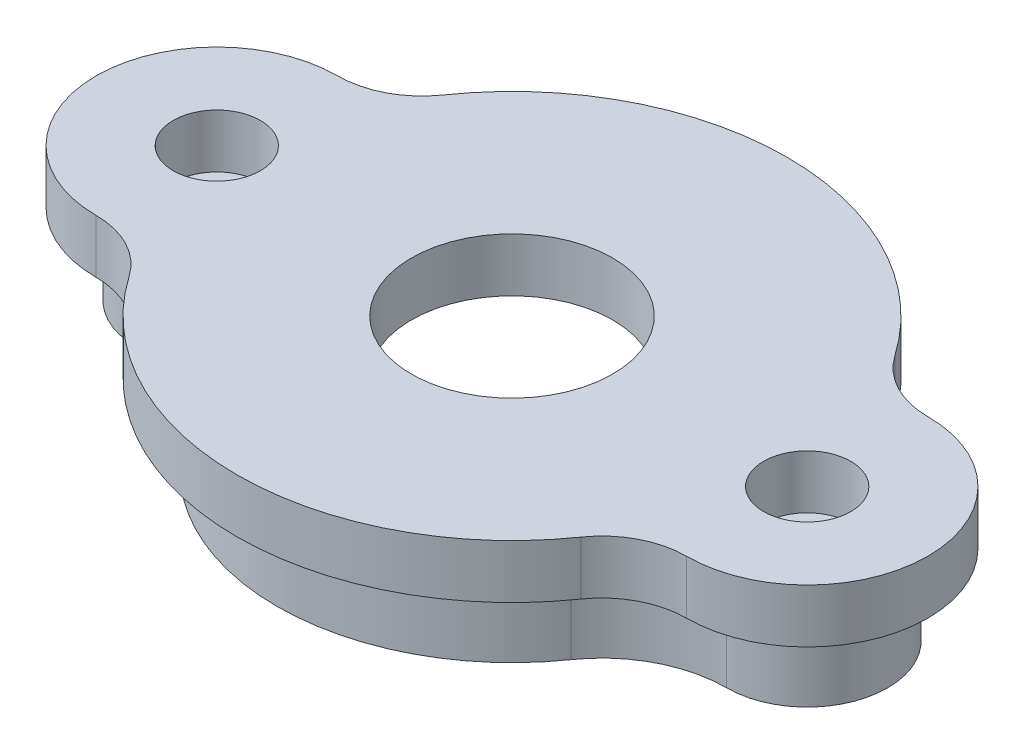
ISO-10303-21;
HEADER;
FILE_DESCRIPTION(('STEP AP214'),'2;1');
FILE_NAME('part.step','',(''),(''),'','','');
FILE_SCHEMA(('AUTOMOTIVE_DESIGN { 1 0 10303 214 1 1 1 1 }'));
ENDSEC;
DATA;
#1=APPLICATION_CONTEXT('core data for automotive mechanical design processes');
#2=APPLICATION_PROTOCOL_DEFINITION('international standard','automotive_design',2000,#1);
#3=PRODUCT_CONTEXT('',#1,'mechanical');
#4=PRODUCT('Part','Part','',(#3));
#5=PRODUCT_RELATED_PRODUCT_CATEGORY('part','',(#4));
#6=PRODUCT_DEFINITION_FORMATION('','',#4);
#7=PRODUCT_DEFINITION_CONTEXT('part definition',#1,'design');
#8=PRODUCT_DEFINITION('design','',#6,#7);
#9=PRODUCT_DEFINITION_SHAPE('','',#8);
#10=(LENGTH_UNIT() NAMED_UNIT(*) SI_UNIT(.MILLI.,.METRE.));
#11=(NAMED_UNIT(*) PLANE_ANGLE_UNIT() SI_UNIT($,.RADIAN.));
#12=(NAMED_UNIT(*) SI_UNIT($,.STERADIAN.) SOLID_ANGLE_UNIT());
#13=UNCERTAINTY_MEASURE_WITH_UNIT(LENGTH_MEASURE(1.E-05),#10,'distance_accuracy_value','');
#14=(GEOMETRIC_REPRESENTATION_CONTEXT(3) GLOBAL_UNCERTAINTY_ASSIGNED_CONTEXT((#13)) GLOBAL_UNIT_ASSIGNED_CONTEXT((#10,
#11,#12)) REPRESENTATION_CONTEXT('',''));
#15=CARTESIAN_POINT('',(0.,0.,0.));
#16=DIRECTION('',(0.,0.,1.));
#17=DIRECTION('',(1.,0.,0.));
#18=AXIS2_PLACEMENT_3D('',#15,#16,#17);
#19=CARTESIAN_POINT('',(0.,-6.,0.));
#20=DIRECTION('',(0.,-1.,0.));
#21=DIRECTION('',(0.,0.,-1.));
#22=AXIS2_PLACEMENT_3D('',#19,#20,#21);
#23=PLANE('',#22);
#24=CARTESIAN_POINT('',(0.,-6.,0.));
#25=DIRECTION('',(0.,-1.,0.));
#26=DIRECTION('',(0.,0.,-1.));
#27=AXIS2_PLACEMENT_3D('',#24,#25,#26);
#28=CIRCLE('',#27,16.);
#29=CARTESIAN_POINT('',(0.,-6.,-16.));
#30=VERTEX_POINT('',#29);
#31=EDGE_CURVE('E649',#30,#30,#28,.T.);
#32=ORIENTED_EDGE('',*,*,#31,.F.);
#33=EDGE_LOOP('',(#32));
#34=FACE_BOUND('',#33,.T.);
#35=CARTESIAN_POINT('',(22.,-6.,15.2934782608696));
#36=DIRECTION('',(0.,-1.,0.));
#37=DIRECTION('',(0.,0.,-1.));
#38=AXIS2_PLACEMENT_3D('',#35,#36,#37);
#39=CIRCLE('',#38,9.29347826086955);
#40=CARTESIAN_POINT('',(14.369168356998,-6.,9.98884381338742));
#41=VERTEX_POINT('',#40);
#42=CARTESIAN_POINT('',(22.,-6.,6.));
#43=VERTEX_POINT('',#42);
#44=EDGE_CURVE('E160',#41,#43,#39,.T.);
#45=ORIENTED_EDGE('',*,*,#44,.F.);
#46=CARTESIAN_POINT('',(0.,-6.,0.));
#47=DIRECTION('',(0.,-1.,0.));
#48=DIRECTION('',(0.,0.,-1.));
#49=AXIS2_PLACEMENT_3D('',#46,#47,#48);
#50=CIRCLE('',#49,17.5);
#51=CARTESIAN_POINT('',(-14.369168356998,-6.,9.98884381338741));
#52=VERTEX_POINT('',#51);
#53=EDGE_CURVE('E168',#41,#52,#50,.T.);
#54=ORIENTED_EDGE('',*,*,#53,.T.);
#55=CARTESIAN_POINT('',(-22.,-6.,15.2934782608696));
#56=DIRECTION('',(0.,-1.,0.));
#57=DIRECTION('',(0.,0.,-1.));
#58=AXIS2_PLACEMENT_3D('',#55,#56,#57);
#59=CIRCLE('',#58,9.29347826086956);
#60=CARTESIAN_POINT('',(-22.,-6.,6.));
#61=VERTEX_POINT('',#60);
#62=EDGE_CURVE('E175',#61,#52,#59,.T.);
#63=ORIENTED_EDGE('',*,*,#62,.F.);
#64=CARTESIAN_POINT('',(-22.,-6.,0.));
#65=DIRECTION('',(0.,-1.,0.));
#66=DIRECTION('',(0.,0.,-1.));
#67=AXIS2_PLACEMENT_3D('',#64,#65,#66);
#68=CIRCLE('',#67,6.);
#69=CARTESIAN_POINT('',(-22.,-6.,-6.));
#70=VERTEX_POINT('',#69);
#71=EDGE_CURVE('E193',#61,#70,#68,.T.);
#72=ORIENTED_EDGE('',*,*,#71,.T.);
#73=CARTESIAN_POINT('',(-22.,-6.,-15.2934782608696));
#74=DIRECTION('',(0.,-1.,0.));
#75=DIRECTION('',(0.,0.,-1.));
#76=AXIS2_PLACEMENT_3D('',#73,#74,#75);
#77=CIRCLE('',#76,9.29347826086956);
#78=CARTESIAN_POINT('',(-14.369168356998,-6.,-9.98884381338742));
#79=VERTEX_POINT('',#78);
#80=EDGE_CURVE('E196',#79,#70,#77,.T.);
#81=ORIENTED_EDGE('',*,*,#80,.F.);
#82=CARTESIAN_POINT('',(0.,-6.,0.));
#83=DIRECTION('',(0.,-1.,0.));
#84=DIRECTION('',(0.,0.,-1.));
#85=AXIS2_PLACEMENT_3D('',#82,#83,#84);
#86=CIRCLE('',#85,17.5);
#87=CARTESIAN_POINT('',(14.369168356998,-6.,-9.98884381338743));
#88=VERTEX_POINT('',#87);
#89=EDGE_CURVE('E200',#79,#88,#86,.T.);
#90=ORIENTED_EDGE('',*,*,#89,.T.);
#91=CARTESIAN_POINT('',(22.,-6.,-15.2934782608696));
#92=DIRECTION('',(0.,-1.,0.));
#93=DIRECTION('',(0.,0.,-1.));
#94=AXIS2_PLACEMENT_3D('',#91,#92,#93);
#95=CIRCLE('',#94,9.29347826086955);
#96=CARTESIAN_POINT('',(22.,-6.,-6.));
#97=VERTEX_POINT('',#96);
#98=EDGE_CURVE('E203',#97,#88,#95,.T.);
#99=ORIENTED_EDGE('',*,*,#98,.F.);
#100=CARTESIAN_POINT('',(22.,-6.,0.));
#101=DIRECTION('',(0.,-1.,0.));
#102=DIRECTION('',(0.,0.,-1.));
#103=AXIS2_PLACEMENT_3D('',#100,#101,#102);
#104=CIRCLE('',#103,6.);
#105=EDGE_CURVE('E180',#97,#43,#104,.T.);
#106=ORIENTED_EDGE('',*,*,#105,.T.);
#107=EDGE_LOOP('',(#45,#54,#63,#72,#81,#90,#99,#106));
#108=FACE_BOUND('',#107,.T.);
#109=CARTESIAN_POINT('',(-22.,-5.99999999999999,0.));
#110=DIRECTION('',(0.,1.,0.));
#111=DIRECTION('',(0.,0.,1.));
#112=AXIS2_PLACEMENT_3D('',#109,#110,#111);
#113=CIRCLE('',#112,1.75000000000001);
#114=CARTESIAN_POINT('',(-22.,-5.99999999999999,1.75000000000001));
#115=VERTEX_POINT('',#114);
#116=EDGE_CURVE('E188',#115,#115,#113,.T.);
#117=ORIENTED_EDGE('',*,*,#116,.T.);
#118=EDGE_LOOP('',(#117));
#119=FACE_BOUND('',#118,.T.);
#120=CARTESIAN_POINT('',(22.,-5.99999999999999,0.));
#121=DIRECTION('',(0.,1.,0.));
#122=DIRECTION('',(0.,0.,1.));
#123=AXIS2_PLACEMENT_3D('',#120,#121,#122);
#124=CIRCLE('',#123,1.75000000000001);
#125=CARTESIAN_POINT('',(22.,-5.99999999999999,1.75000000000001));
#126=VERTEX_POINT('',#125);
#127=EDGE_CURVE('E675',#126,#126,#124,.T.);
#128=ORIENTED_EDGE('',*,*,#127,.T.);
#129=EDGE_LOOP('',(#128));
#130=FACE_BOUND('',#129,.T.);
#131=ADVANCED_FACE('F43',(#34,#108,#119,#130),#23,.T.);
#132=CARTESIAN_POINT('',(11.,0.,-7.64673913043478));
#133=DIRECTION('',(0.,-1.,0.));
#134=DIRECTION('',(0.,0.,-1.));
#135=AXIS2_PLACEMENT_3D('',#132,#133,#134);
#136=PLANE('',#135);
#137=CARTESIAN_POINT('',(22.,0.,-15.2934782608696));
#138=DIRECTION('',(0.,-1.,0.));
#139=DIRECTION('',(0.,0.,-1.));
#140=AXIS2_PLACEMENT_3D('',#137,#138,#139);
#141=CIRCLE('',#140,6.29347826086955);
#142=CARTESIAN_POINT('',(22.,0.,-9.));
#143=VERTEX_POINT('',#142);
#144=CARTESIAN_POINT('',(16.8324543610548,0.,-11.7012170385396));
#145=VERTEX_POINT('',#144);
#146=EDGE_CURVE('E164',#143,#145,#141,.T.);
#147=ORIENTED_EDGE('',*,*,#146,.F.);
#148=CARTESIAN_POINT('',(22.,0.,0.));
#149=DIRECTION('',(0.,1.,0.));
#150=DIRECTION('',(0.,0.,1.));
#151=AXIS2_PLACEMENT_3D('',#148,#149,#150);
#152=CIRCLE('',#151,9.);
#153=CARTESIAN_POINT('',(22.,0.,9.));
#154=VERTEX_POINT('',#153);
#155=EDGE_CURVE('E259',#154,#143,#152,.T.);
#156=ORIENTED_EDGE('',*,*,#155,.F.);
#157=CARTESIAN_POINT('',(22.,0.,15.2934782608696));
#158=DIRECTION('',(0.,-1.,0.));
#159=DIRECTION('',(0.,0.,1.));
#160=AXIS2_PLACEMENT_3D('',#157,#158,#159);
#161=CIRCLE('',#160,6.29347826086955);
#162=CARTESIAN_POINT('',(16.8324543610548,0.,11.7012170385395));
#163=VERTEX_POINT('',#162);
#164=EDGE_CURVE('E299',#163,#154,#161,.T.);
#165=ORIENTED_EDGE('',*,*,#164,.F.);
#166=CARTESIAN_POINT('',(0.,0.,0.));
#167=DIRECTION('',(0.,1.,0.));
#168=DIRECTION('',(0.,0.,1.));
#169=AXIS2_PLACEMENT_3D('',#166,#167,#168);
#170=CIRCLE('',#169,20.5);
#171=CARTESIAN_POINT('',(-16.8324543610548,0.,11.7012170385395));
#172=VERTEX_POINT('',#171);
#173=EDGE_CURVE('E296',#172,#163,#170,.T.);
#174=ORIENTED_EDGE('',*,*,#173,.F.);
#175=CARTESIAN_POINT('',(-22.,0.,15.2934782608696));
#176=DIRECTION('',(0.,-1.,0.));
#177=DIRECTION('',(0.,0.,-1.));
#178=AXIS2_PLACEMENT_3D('',#175,#176,#177);
#179=CIRCLE('',#178,6.29347826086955);
#180=CARTESIAN_POINT('',(-22.,0.,9.));
#181=VERTEX_POINT('',#180);
#182=EDGE_CURVE('E293',#181,#172,#179,.T.);
#183=ORIENTED_EDGE('',*,*,#182,.F.);
#184=CARTESIAN_POINT('',(-22.,0.,0.));
#185=DIRECTION('',(0.,1.,0.));
#186=DIRECTION('',(0.,0.,-1.));
#187=AXIS2_PLACEMENT_3D('',#184,#185,#186);
#188=CIRCLE('',#187,9.);
#189=CARTESIAN_POINT('',(-22.,0.,-9.));
#190=VERTEX_POINT('',#189);
#191=EDGE_CURVE('E290',#190,#181,#188,.T.);
#192=ORIENTED_EDGE('',*,*,#191,.F.);
#193=CARTESIAN_POINT('',(-22.,0.,-15.2934782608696));
#194=DIRECTION('',(0.,-1.,0.));
#195=DIRECTION('',(0.,0.,1.));
#196=AXIS2_PLACEMENT_3D('',#193,#194,#195);
#197=CIRCLE('',#196,6.29347826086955);
#198=CARTESIAN_POINT('',(-16.8324543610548,0.,-11.7012170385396));
#199=VERTEX_POINT('',#198);
#200=EDGE_CURVE('E287',#199,#190,#197,.T.);
#201=ORIENTED_EDGE('',*,*,#200,.F.);
#202=CARTESIAN_POINT('',(0.,0.,0.));
#203=DIRECTION('',(0.,1.,0.));
#204=DIRECTION('',(0.,0.,1.));
#205=AXIS2_PLACEMENT_3D('',#202,#203,#204);
#206=CIRCLE('',#205,20.5);
#207=EDGE_CURVE('E284',#145,#199,#206,.T.);
#208=ORIENTED_EDGE('',*,*,#207,.F.);
#209=EDGE_LOOP('',(#147,#156,#165,#174,#183,#192,#201,#208));
#210=FACE_BOUND('',#209,.T.);
#211=CARTESIAN_POINT('',(0.,0.,0.));
#212=DIRECTION('',(0.,-1.,0.));
#213=DIRECTION('',(0.,0.,-1.));
#214=AXIS2_PLACEMENT_3D('',#211,#212,#213);
#215=CIRCLE('',#214,17.5);
#216=CARTESIAN_POINT('',(14.369168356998,0.,9.98884381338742));
#217=VERTEX_POINT('',#216);
#218=CARTESIAN_POINT('',(-14.369168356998,0.,9.98884381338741));
#219=VERTEX_POINT('',#218);
#220=EDGE_CURVE('E212',#217,#219,#215,.T.);
#221=ORIENTED_EDGE('',*,*,#220,.F.);
#222=CARTESIAN_POINT('',(22.,0.,15.2934782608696));
#223=DIRECTION('',(0.,-1.,0.));
#224=DIRECTION('',(0.,0.,-1.));
#225=AXIS2_PLACEMENT_3D('',#222,#223,#224);
#226=CIRCLE('',#225,9.29347826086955);
#227=CARTESIAN_POINT('',(22.,0.,6.));
#228=VERTEX_POINT('',#227);
#229=EDGE_CURVE('E59',#217,#228,#226,.T.);
#230=ORIENTED_EDGE('',*,*,#229,.T.);
#231=CARTESIAN_POINT('',(22.,0.,0.));
#232=DIRECTION('',(0.,-1.,0.));
#233=DIRECTION('',(0.,0.,-1.));
#234=AXIS2_PLACEMENT_3D('',#231,#232,#233);
#235=CIRCLE('',#234,6.);
#236=CARTESIAN_POINT('',(22.,0.,-6.));
#237=VERTEX_POINT('',#236);
#238=EDGE_CURVE('E64',#237,#228,#235,.T.);
#239=ORIENTED_EDGE('',*,*,#238,.F.);
#240=CARTESIAN_POINT('',(22.,0.,-15.2934782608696));
#241=DIRECTION('',(0.,-1.,0.));
#242=DIRECTION('',(0.,0.,-1.));
#243=AXIS2_PLACEMENT_3D('',#240,#241,#242);
#244=CIRCLE('',#243,9.29347826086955);
#245=CARTESIAN_POINT('',(14.369168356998,0.,-9.98884381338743));
#246=VERTEX_POINT('',#245);
#247=EDGE_CURVE('E185',#237,#246,#244,.T.);
#248=ORIENTED_EDGE('',*,*,#247,.T.);
#249=CARTESIAN_POINT('',(0.,0.,0.));
#250=DIRECTION('',(0.,-1.,0.));
#251=DIRECTION('',(0.,0.,-1.));
#252=AXIS2_PLACEMENT_3D('',#249,#250,#251);
#253=CIRCLE('',#252,17.5);
#254=CARTESIAN_POINT('',(-14.369168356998,0.,-9.98884381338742));
#255=VERTEX_POINT('',#254);
#256=EDGE_CURVE('E225',#255,#246,#253,.T.);
#257=ORIENTED_EDGE('',*,*,#256,.F.);
#258=CARTESIAN_POINT('',(-22.,0.,-15.2934782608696));
#259=DIRECTION('',(0.,-1.,0.));
#260=DIRECTION('',(0.,0.,-1.));
#261=AXIS2_PLACEMENT_3D('',#258,#259,#260);
#262=CIRCLE('',#261,9.29347826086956);
#263=CARTESIAN_POINT('',(-22.,0.,-6.));
#264=VERTEX_POINT('',#263);
#265=EDGE_CURVE('E222',#255,#264,#262,.T.);
#266=ORIENTED_EDGE('',*,*,#265,.T.);
#267=CARTESIAN_POINT('',(-22.,0.,0.));
#268=DIRECTION('',(0.,-1.,0.));
#269=DIRECTION('',(0.,0.,-1.));
#270=AXIS2_PLACEMENT_3D('',#267,#268,#269);
#271=CIRCLE('',#270,6.);
#272=CARTESIAN_POINT('',(-22.,0.,6.));
#273=VERTEX_POINT('',#272);
#274=EDGE_CURVE('E218',#273,#264,#271,.T.);
#275=ORIENTED_EDGE('',*,*,#274,.F.);
#276=CARTESIAN_POINT('',(-22.,0.,15.2934782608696));
#277=DIRECTION('',(0.,-1.,0.));
#278=DIRECTION('',(0.,0.,-1.));
#279=AXIS2_PLACEMENT_3D('',#276,#277,#278);
#280=CIRCLE('',#279,9.29347826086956);
#281=EDGE_CURVE('E215',#273,#219,#280,.T.);
#282=ORIENTED_EDGE('',*,*,#281,.T.);
#283=EDGE_LOOP('',(#221,#230,#239,#248,#257,#266,#275,#282));
#284=FACE_BOUND('',#283,.T.);
#285=ADVANCED_FACE('F338',(#210,#284),#136,.T.);
#286=CARTESIAN_POINT('',(22.,4.,-15.2934782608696));
#287=DIRECTION('',(0.,-1.,0.));
#288=DIRECTION('',(0.,0.,-1.));
#289=AXIS2_PLACEMENT_3D('',#286,#287,#288);
#290=CYLINDRICAL_SURFACE('',#289,6.29347826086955);
#291=ORIENTED_EDGE('',*,*,#146,.T.);
#292=DIRECTION('',(0.,-1.,0.));
#293=VECTOR('',#292,1.);
#294=CARTESIAN_POINT('',(16.8324543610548,4.,-11.7012170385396));
#295=LINE('',#294,#293);
#296=CARTESIAN_POINT('',(16.8324543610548,4.,-11.7012170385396));
#297=VERTEX_POINT('',#296);
#298=EDGE_CURVE('E11',#297,#145,#295,.T.);
#299=ORIENTED_EDGE('',*,*,#298,.F.);
#300=CARTESIAN_POINT('',(22.,4.,-15.2934782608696));
#301=DIRECTION('',(0.,-1.,0.));
#302=DIRECTION('',(0.,0.,-1.));
#303=AXIS2_PLACEMENT_3D('',#300,#301,#302);
#304=CIRCLE('',#303,6.29347826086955);
#305=CARTESIAN_POINT('',(22.,4.,-9.));
#306=VERTEX_POINT('',#305);
#307=EDGE_CURVE('E254',#306,#297,#304,.T.);
#308=ORIENTED_EDGE('',*,*,#307,.F.);
#309=DIRECTION('',(0.,-1.,0.));
#310=VECTOR('',#309,1.);
#311=CARTESIAN_POINT('',(22.,4.,-9.));
#312=LINE('',#311,#310);
#313=EDGE_CURVE('E280',#306,#143,#312,.T.);
#314=ORIENTED_EDGE('',*,*,#313,.T.);
#315=EDGE_LOOP('',(#291,#299,#308,#314));
#316=FACE_BOUND('',#315,.T.);
#317=ADVANCED_FACE('F45',(#316),#290,.F.);
#318=CARTESIAN_POINT('',(0.,4.,0.));
#319=DIRECTION('',(0.,-1.,0.));
#320=DIRECTION('',(0.,0.,-1.));
#321=AXIS2_PLACEMENT_3D('',#318,#319,#320);
#322=CYLINDRICAL_SURFACE('',#321,20.5);
#323=ORIENTED_EDGE('',*,*,#207,.T.);
#324=DIRECTION('',(0.,-1.,0.));
#325=VECTOR('',#324,1.);
#326=CARTESIAN_POINT('',(-16.8324543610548,4.,-11.7012170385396));
#327=LINE('',#326,#325);
#328=CARTESIAN_POINT('',(-16.8324543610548,4.,-11.7012170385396));
#329=VERTEX_POINT('',#328);
#330=EDGE_CURVE('E52',#329,#199,#327,.T.);
#331=ORIENTED_EDGE('',*,*,#330,.F.);
#332=CARTESIAN_POINT('',(0.,4.,0.));
#333=DIRECTION('',(0.,1.,0.));
#334=DIRECTION('',(0.,0.,1.));
#335=AXIS2_PLACEMENT_3D('',#332,#333,#334);
#336=CIRCLE('',#335,20.5);
#337=EDGE_CURVE('E258',#297,#329,#336,.T.);
#338=ORIENTED_EDGE('',*,*,#337,.F.);
#339=ORIENTED_EDGE('',*,*,#298,.T.);
#340=EDGE_LOOP('',(#323,#331,#338,#339));
#341=FACE_BOUND('',#340,.T.);
#342=ADVANCED_FACE('F355',(#341),#322,.T.);
#343=CARTESIAN_POINT('',(-22.,4.,-15.2934782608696));
#344=DIRECTION('',(0.,-1.,0.));
#345=DIRECTION('',(0.,0.,-1.));
#346=AXIS2_PLACEMENT_3D('',#343,#344,#345);
#347=CYLINDRICAL_SURFACE('',#346,6.29347826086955);
#348=ORIENTED_EDGE('',*,*,#200,.T.);
#349=DIRECTION('',(0.,-1.,0.));
#350=VECTOR('',#349,1.);
#351=CARTESIAN_POINT('',(-22.,4.,-9.));
#352=LINE('',#351,#350);
#353=CARTESIAN_POINT('',(-22.,4.,-9.));
#354=VERTEX_POINT('',#353);
#355=EDGE_CURVE('E323',#354,#190,#352,.T.);
#356=ORIENTED_EDGE('',*,*,#355,.F.);
#357=CARTESIAN_POINT('',(-22.,4.,-15.2934782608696));
#358=DIRECTION('',(0.,-1.,0.));
#359=DIRECTION('',(0.,0.,1.));
#360=AXIS2_PLACEMENT_3D('',#357,#358,#359);
#361=CIRCLE('',#360,6.29347826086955);
#362=EDGE_CURVE('E262',#329,#354,#361,.T.);
#363=ORIENTED_EDGE('',*,*,#362,.F.);
#364=ORIENTED_EDGE('',*,*,#330,.T.);
#365=EDGE_LOOP('',(#348,#356,#363,#364));
#366=FACE_BOUND('',#365,.T.);
#367=ADVANCED_FACE('F332',(#366),#347,.F.);
#368=CARTESIAN_POINT('',(-22.,4.,0.));
#369=DIRECTION('',(0.,-1.,0.));
#370=DIRECTION('',(0.,0.,-1.));
#371=AXIS2_PLACEMENT_3D('',#368,#369,#370);
#372=CYLINDRICAL_SURFACE('',#371,9.);
#373=ORIENTED_EDGE('',*,*,#191,.T.);
#374=DIRECTION('',(0.,-1.,0.));
#375=VECTOR('',#374,1.);
#376=CARTESIAN_POINT('',(-22.,4.,9.));
#377=LINE('',#376,#375);
#378=CARTESIAN_POINT('',(-22.,4.,9.));
#379=VERTEX_POINT('',#378);
#380=EDGE_CURVE('E319',#379,#181,#377,.T.);
#381=ORIENTED_EDGE('',*,*,#380,.F.);
#382=CARTESIAN_POINT('',(-22.,4.,0.));
#383=DIRECTION('',(0.,1.,0.));
#384=DIRECTION('',(0.,0.,-1.));
#385=AXIS2_PLACEMENT_3D('',#382,#383,#384);
#386=CIRCLE('',#385,9.);
#387=EDGE_CURVE('E265',#354,#379,#386,.T.);
#388=ORIENTED_EDGE('',*,*,#387,.F.);
#389=ORIENTED_EDGE('',*,*,#355,.T.);
#390=EDGE_LOOP('',(#373,#381,#388,#389));
#391=FACE_BOUND('',#390,.T.);
#392=ADVANCED_FACE('F343',(#391),#372,.T.);
#393=CARTESIAN_POINT('',(-22.,4.,15.2934782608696));
#394=DIRECTION('',(0.,-1.,0.));
#395=DIRECTION('',(0.,0.,-1.));
#396=AXIS2_PLACEMENT_3D('',#393,#394,#395);
#397=CYLINDRICAL_SURFACE('',#396,6.29347826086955);
#398=ORIENTED_EDGE('',*,*,#182,.T.);
#399=DIRECTION('',(0.,-1.,0.));
#400=VECTOR('',#399,1.);
#401=CARTESIAN_POINT('',(-16.8324543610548,4.,11.7012170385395));
#402=LINE('',#401,#400);
#403=CARTESIAN_POINT('',(-16.8324543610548,4.,11.7012170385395));
#404=VERTEX_POINT('',#403);
#405=EDGE_CURVE('E315',#404,#172,#402,.T.);
#406=ORIENTED_EDGE('',*,*,#405,.F.);
#407=CARTESIAN_POINT('',(-22.,4.,15.2934782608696));
#408=DIRECTION('',(0.,-1.,0.));
#409=DIRECTION('',(0.,0.,-1.));
#410=AXIS2_PLACEMENT_3D('',#407,#408,#409);
#411=CIRCLE('',#410,6.29347826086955);
#412=EDGE_CURVE('E268',#379,#404,#411,.T.);
#413=ORIENTED_EDGE('',*,*,#412,.F.);
#414=ORIENTED_EDGE('',*,*,#380,.T.);
#415=EDGE_LOOP('',(#398,#406,#413,#414));
#416=FACE_BOUND('',#415,.T.);
#417=ADVANCED_FACE('F347',(#416),#397,.F.);
#418=CARTESIAN_POINT('',(0.,4.,0.));
#419=DIRECTION('',(0.,-1.,0.));
#420=DIRECTION('',(0.,0.,-1.));
#421=AXIS2_PLACEMENT_3D('',#418,#419,#420);
#422=CYLINDRICAL_SURFACE('',#421,20.5);
#423=ORIENTED_EDGE('',*,*,#173,.T.);
#424=DIRECTION('',(0.,-1.,0.));
#425=VECTOR('',#424,1.);
#426=CARTESIAN_POINT('',(16.8324543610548,4.,11.7012170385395));
#427=LINE('',#426,#425);
#428=CARTESIAN_POINT('',(16.8324543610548,4.,11.7012170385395));
#429=VERTEX_POINT('',#428);
#430=EDGE_CURVE('E311',#429,#163,#427,.T.);
#431=ORIENTED_EDGE('',*,*,#430,.F.);
#432=CARTESIAN_POINT('',(0.,4.,0.));
#433=DIRECTION('',(0.,1.,0.));
#434=DIRECTION('',(0.,0.,1.));
#435=AXIS2_PLACEMENT_3D('',#432,#433,#434);
#436=CIRCLE('',#435,20.5);
#437=EDGE_CURVE('E271',#404,#429,#436,.T.);
#438=ORIENTED_EDGE('',*,*,#437,.F.);
#439=ORIENTED_EDGE('',*,*,#405,.T.);
#440=EDGE_LOOP('',(#423,#431,#438,#439));
#441=FACE_BOUND('',#440,.T.);
#442=ADVANCED_FACE('F368',(#441),#422,.T.);
#443=CARTESIAN_POINT('',(22.,4.,15.2934782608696));
#444=DIRECTION('',(0.,-1.,0.));
#445=DIRECTION('',(0.,0.,-1.));
#446=AXIS2_PLACEMENT_3D('',#443,#444,#445);
#447=CYLINDRICAL_SURFACE('',#446,6.29347826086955);
#448=ORIENTED_EDGE('',*,*,#164,.T.);
#449=DIRECTION('',(0.,-1.,0.));
#450=VECTOR('',#449,1.);
#451=CARTESIAN_POINT('',(22.,4.,9.));
#452=LINE('',#451,#450);
#453=CARTESIAN_POINT('',(22.,4.,9.));
#454=VERTEX_POINT('',#453);
#455=EDGE_CURVE('E307',#454,#154,#452,.T.);
#456=ORIENTED_EDGE('',*,*,#455,.F.);
#457=CARTESIAN_POINT('',(22.,4.,15.2934782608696));
#458=DIRECTION('',(0.,-1.,0.));
#459=DIRECTION('',(0.,0.,1.));
#460=AXIS2_PLACEMENT_3D('',#457,#458,#459);
#461=CIRCLE('',#460,6.29347826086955);
#462=EDGE_CURVE('E274',#429,#454,#461,.T.);
#463=ORIENTED_EDGE('',*,*,#462,.F.);
#464=ORIENTED_EDGE('',*,*,#430,.T.);
#465=EDGE_LOOP('',(#448,#456,#463,#464));
#466=FACE_BOUND('',#465,.T.);
#467=ADVANCED_FACE('F366',(#466),#447,.F.);
#468=CARTESIAN_POINT('',(22.,4.,0.));
#469=DIRECTION('',(0.,-1.,0.));
#470=DIRECTION('',(0.,0.,-1.));
#471=AXIS2_PLACEMENT_3D('',#468,#469,#470);
#472=CYLINDRICAL_SURFACE('',#471,9.);
#473=ORIENTED_EDGE('',*,*,#155,.T.);
#474=ORIENTED_EDGE('',*,*,#313,.F.);
#475=CARTESIAN_POINT('',(22.,4.,0.));
#476=DIRECTION('',(0.,1.,0.));
#477=DIRECTION('',(0.,0.,1.));
#478=AXIS2_PLACEMENT_3D('',#475,#476,#477);
#479=CIRCLE('',#478,9.);
#480=EDGE_CURVE('E277',#454,#306,#479,.T.);
#481=ORIENTED_EDGE('',*,*,#480,.F.);
#482=ORIENTED_EDGE('',*,*,#455,.T.);
#483=EDGE_LOOP('',(#473,#474,#481,#482));
#484=FACE_BOUND('',#483,.T.);
#485=ADVANCED_FACE('F361',(#484),#472,.T.);
#486=CARTESIAN_POINT('',(11.,4.,-7.64673913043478));
#487=DIRECTION('',(0.,-1.,0.));
#488=DIRECTION('',(0.,0.,-1.));
#489=AXIS2_PLACEMENT_3D('',#486,#487,#488);
#490=PLANE('',#489);
#491=CARTESIAN_POINT('',(0.,4.,0.));
#492=DIRECTION('',(0.,-1.,0.));
#493=DIRECTION('',(0.,0.,-1.));
#494=AXIS2_PLACEMENT_3D('',#491,#492,#493);
#495=CIRCLE('',#494,7.50000000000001);
#496=CARTESIAN_POINT('',(0.,4.,-7.50000000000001));
#497=VERTEX_POINT('',#496);
#498=EDGE_CURVE('E659',#497,#497,#495,.T.);
#499=ORIENTED_EDGE('',*,*,#498,.T.);
#500=EDGE_LOOP('',(#499));
#501=FACE_BOUND('',#500,.T.);
#502=CARTESIAN_POINT('',(22.,4.,0.));
#503=DIRECTION('',(0.,1.,0.));
#504=DIRECTION('',(0.,0.,1.));
#505=AXIS2_PLACEMENT_3D('',#502,#503,#504);
#506=CIRCLE('',#505,3.25000000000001);
#507=CARTESIAN_POINT('',(22.,4.,3.25000000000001));
#508=VERTEX_POINT('',#507);
#509=EDGE_CURVE('E663',#508,#508,#506,.T.);
#510=ORIENTED_EDGE('',*,*,#509,.F.);
#511=EDGE_LOOP('',(#510));
#512=FACE_BOUND('',#511,.T.);
#513=CARTESIAN_POINT('',(-22.,4.,0.));
#514=DIRECTION('',(0.,1.,0.));
#515=DIRECTION('',(0.,0.,1.));
#516=AXIS2_PLACEMENT_3D('',#513,#514,#515);
#517=CIRCLE('',#516,3.25000000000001);
#518=CARTESIAN_POINT('',(-22.,4.,3.25000000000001));
#519=VERTEX_POINT('',#518);
#520=EDGE_CURVE('E679',#519,#519,#517,.T.);
#521=ORIENTED_EDGE('',*,*,#520,.F.);
#522=EDGE_LOOP('',(#521));
#523=FACE_BOUND('',#522,.T.);
#524=ORIENTED_EDGE('',*,*,#307,.T.);
#525=ORIENTED_EDGE('',*,*,#337,.T.);
#526=ORIENTED_EDGE('',*,*,#362,.T.);
#527=ORIENTED_EDGE('',*,*,#387,.T.);
#528=ORIENTED_EDGE('',*,*,#412,.T.);
#529=ORIENTED_EDGE('',*,*,#437,.T.);
#530=ORIENTED_EDGE('',*,*,#462,.T.);
#531=ORIENTED_EDGE('',*,*,#480,.T.);
#532=EDGE_LOOP('',(#524,#525,#526,#527,#528,#529,#530,#531));
#533=FACE_BOUND('',#532,.T.);
#534=ADVANCED_FACE('F351',(#501,#512,#523,#533),#490,.F.);
#535=CARTESIAN_POINT('',(22.,-6.,15.2934782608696));
#536=DIRECTION('',(0.,1.,0.));
#537=DIRECTION('',(0.,0.,1.));
#538=AXIS2_PLACEMENT_3D('',#535,#536,#537);
#539=CYLINDRICAL_SURFACE('',#538,9.29347826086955);
#540=ORIENTED_EDGE('',*,*,#229,.F.);
#541=DIRECTION('',(0.,1.,0.));
#542=VECTOR('',#541,1.);
#543=CARTESIAN_POINT('',(14.369168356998,-6.,9.98884381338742));
#544=LINE('',#543,#542);
#545=EDGE_CURVE('E156',#41,#217,#544,.T.);
#546=ORIENTED_EDGE('',*,*,#545,.F.);
#547=ORIENTED_EDGE('',*,*,#44,.T.);
#548=DIRECTION('',(0.,1.,0.));
#549=VECTOR('',#548,1.);
#550=CARTESIAN_POINT('',(22.,-6.,6.));
#551=LINE('',#550,#549);
#552=EDGE_CURVE('E209',#43,#228,#551,.T.);
#553=ORIENTED_EDGE('',*,*,#552,.T.);
#554=EDGE_LOOP('',(#540,#546,#547,#553));
#555=FACE_BOUND('',#554,.T.);
#556=ADVANCED_FACE('F158',(#555),#539,.F.);
#557=CARTESIAN_POINT('',(0.,-6.,0.));
#558=DIRECTION('',(0.,1.,0.));
#559=DIRECTION('',(0.,0.,1.));
#560=AXIS2_PLACEMENT_3D('',#557,#558,#559);
#561=CYLINDRICAL_SURFACE('',#560,17.5);
#562=ORIENTED_EDGE('',*,*,#220,.T.);
#563=DIRECTION('',(0.,1.,0.));
#564=VECTOR('',#563,1.);
#565=CARTESIAN_POINT('',(-14.369168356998,-6.,9.98884381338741));
#566=LINE('',#565,#564);
#567=EDGE_CURVE('E165',#52,#219,#566,.T.);
#568=ORIENTED_EDGE('',*,*,#567,.F.);
#569=ORIENTED_EDGE('',*,*,#53,.F.);
#570=ORIENTED_EDGE('',*,*,#545,.T.);
#571=EDGE_LOOP('',(#562,#568,#569,#570));
#572=FACE_BOUND('',#571,.T.);
#573=ADVANCED_FACE('F169',(#572),#561,.T.);
#574=CARTESIAN_POINT('',(-22.,-6.,15.2934782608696));
#575=DIRECTION('',(0.,1.,0.));
#576=DIRECTION('',(0.,0.,1.));
#577=AXIS2_PLACEMENT_3D('',#574,#575,#576);
#578=CYLINDRICAL_SURFACE('',#577,9.29347826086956);
#579=ORIENTED_EDGE('',*,*,#281,.F.);
#580=DIRECTION('',(0.,1.,0.));
#581=VECTOR('',#580,1.);
#582=CARTESIAN_POINT('',(-22.,-6.,6.));
#583=LINE('',#582,#581);
#584=EDGE_CURVE('E248',#61,#273,#583,.T.);
#585=ORIENTED_EDGE('',*,*,#584,.F.);
#586=ORIENTED_EDGE('',*,*,#62,.T.);
#587=ORIENTED_EDGE('',*,*,#567,.T.);
#588=EDGE_LOOP('',(#579,#585,#586,#587));
#589=FACE_BOUND('',#588,.T.);
#590=ADVANCED_FACE('F408',(#589),#578,.F.);
#591=CARTESIAN_POINT('',(-22.,-6.,0.));
#592=DIRECTION('',(0.,1.,0.));
#593=DIRECTION('',(0.,0.,1.));
#594=AXIS2_PLACEMENT_3D('',#591,#592,#593);
#595=CYLINDRICAL_SURFACE('',#594,6.);
#596=ORIENTED_EDGE('',*,*,#274,.T.);
#597=DIRECTION('',(0.,1.,0.));
#598=VECTOR('',#597,1.);
#599=CARTESIAN_POINT('',(-22.,-6.,-6.));
#600=LINE('',#599,#598);
#601=EDGE_CURVE('E244',#70,#264,#600,.T.);
#602=ORIENTED_EDGE('',*,*,#601,.F.);
#603=ORIENTED_EDGE('',*,*,#71,.F.);
#604=ORIENTED_EDGE('',*,*,#584,.T.);
#605=EDGE_LOOP('',(#596,#602,#603,#604));
#606=FACE_BOUND('',#605,.T.);
#607=ADVANCED_FACE('F404',(#606),#595,.T.);
#608=CARTESIAN_POINT('',(-22.,-6.,-15.2934782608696));
#609=DIRECTION('',(0.,1.,0.));
#610=DIRECTION('',(0.,0.,1.));
#611=AXIS2_PLACEMENT_3D('',#608,#609,#610);
#612=CYLINDRICAL_SURFACE('',#611,9.29347826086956);
#613=ORIENTED_EDGE('',*,*,#265,.F.);
#614=DIRECTION('',(0.,1.,0.));
#615=VECTOR('',#614,1.);
#616=CARTESIAN_POINT('',(-14.369168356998,-6.,-9.98884381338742));
#617=LINE('',#616,#615);
#618=EDGE_CURVE('E240',#79,#255,#617,.T.);
#619=ORIENTED_EDGE('',*,*,#618,.F.);
#620=ORIENTED_EDGE('',*,*,#80,.T.);
#621=ORIENTED_EDGE('',*,*,#601,.T.);
#622=EDGE_LOOP('',(#613,#619,#620,#621));
#623=FACE_BOUND('',#622,.T.);
#624=ADVANCED_FACE('F400',(#623),#612,.F.);
#625=CARTESIAN_POINT('',(0.,-6.,0.));
#626=DIRECTION('',(0.,1.,0.));
#627=DIRECTION('',(0.,0.,1.));
#628=AXIS2_PLACEMENT_3D('',#625,#626,#627);
#629=CYLINDRICAL_SURFACE('',#628,17.5);
#630=ORIENTED_EDGE('',*,*,#256,.T.);
#631=DIRECTION('',(0.,1.,0.));
#632=VECTOR('',#631,1.);
#633=CARTESIAN_POINT('',(14.369168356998,-6.,-9.98884381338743));
#634=LINE('',#633,#632);
#635=EDGE_CURVE('E236',#88,#246,#634,.T.);
#636=ORIENTED_EDGE('',*,*,#635,.F.);
#637=ORIENTED_EDGE('',*,*,#89,.F.);
#638=ORIENTED_EDGE('',*,*,#618,.T.);
#639=EDGE_LOOP('',(#630,#636,#637,#638));
#640=FACE_BOUND('',#639,.T.);
#641=ADVANCED_FACE('F396',(#640),#629,.T.);
#642=CARTESIAN_POINT('',(22.,-6.,-15.2934782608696));
#643=DIRECTION('',(0.,1.,0.));
#644=DIRECTION('',(0.,0.,1.));
#645=AXIS2_PLACEMENT_3D('',#642,#643,#644);
#646=CYLINDRICAL_SURFACE('',#645,9.29347826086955);
#647=ORIENTED_EDGE('',*,*,#247,.F.);
#648=DIRECTION('',(0.,1.,0.));
#649=VECTOR('',#648,1.);
#650=CARTESIAN_POINT('',(22.,-6.,-6.));
#651=LINE('',#650,#649);
#652=EDGE_CURVE('E233',#97,#237,#651,.T.);
#653=ORIENTED_EDGE('',*,*,#652,.F.);
#654=ORIENTED_EDGE('',*,*,#98,.T.);
#655=ORIENTED_EDGE('',*,*,#635,.T.);
#656=EDGE_LOOP('',(#647,#653,#654,#655));
#657=FACE_BOUND('',#656,.T.);
#658=ADVANCED_FACE('F392',(#657),#646,.F.);
#659=CARTESIAN_POINT('',(22.,-6.,0.));
#660=DIRECTION('',(0.,1.,0.));
#661=DIRECTION('',(0.,0.,1.));
#662=AXIS2_PLACEMENT_3D('',#659,#660,#661);
#663=CYLINDRICAL_SURFACE('',#662,6.);
#664=ORIENTED_EDGE('',*,*,#238,.T.);
#665=ORIENTED_EDGE('',*,*,#552,.F.);
#666=ORIENTED_EDGE('',*,*,#105,.F.);
#667=ORIENTED_EDGE('',*,*,#652,.T.);
#668=EDGE_LOOP('',(#664,#665,#666,#667));
#669=FACE_BOUND('',#668,.T.);
#670=ADVANCED_FACE('F389',(#669),#663,.T.);
#671=CARTESIAN_POINT('',(-22.,4.,0.));
#672=DIRECTION('',(0.,1.,0.));
#673=DIRECTION('',(0.,0.,1.));
#674=AXIS2_PLACEMENT_3D('',#671,#672,#673);
#675=CYLINDRICAL_SURFACE('',#674,1.75000000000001);
#676=ORIENTED_EDGE('',*,*,#116,.F.);
#677=EDGE_LOOP('',(#676));
#678=FACE_BOUND('',#677,.T.);
#679=CARTESIAN_POINT('',(-22.,0.,0.));
#680=DIRECTION('',(0.,1.,0.));
#681=DIRECTION('',(0.,0.,1.));
#682=AXIS2_PLACEMENT_3D('',#679,#680,#681);
#683=CIRCLE('',#682,1.75000000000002);
#684=CARTESIAN_POINT('',(-22.,0.,1.75000000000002));
#685=VERTEX_POINT('',#684);
#686=EDGE_CURVE('E686',#685,#685,#683,.T.);
#687=ORIENTED_EDGE('',*,*,#686,.T.);
#688=EDGE_LOOP('',(#687));
#689=FACE_BOUND('',#688,.T.);
#690=ADVANCED_FACE('F387',(#678,#689),#675,.F.);
#691=CARTESIAN_POINT('',(-20.25,0.,0.));
#692=DIRECTION('',(0.,-1.,0.));
#693=DIRECTION('',(0.,0.,-1.));
#694=AXIS2_PLACEMENT_3D('',#691,#692,#693);
#695=PLANE('',#694);
#696=ORIENTED_EDGE('',*,*,#686,.F.);
#697=EDGE_LOOP('',(#696));
#698=FACE_BOUND('',#697,.T.);
#699=CARTESIAN_POINT('',(-22.,0.,0.));
#700=DIRECTION('',(0.,1.,0.));
#701=DIRECTION('',(0.,0.,1.));
#702=AXIS2_PLACEMENT_3D('',#699,#700,#701);
#703=CIRCLE('',#702,3.25000000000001);
#704=CARTESIAN_POINT('',(-22.,0.,3.25000000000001));
#705=VERTEX_POINT('',#704);
#706=EDGE_CURVE('E683',#705,#705,#703,.T.);
#707=ORIENTED_EDGE('',*,*,#706,.T.);
#708=EDGE_LOOP('',(#707));
#709=FACE_BOUND('',#708,.T.);
#710=ADVANCED_FACE('F471',(#698,#709),#695,.F.);
#711=CARTESIAN_POINT('',(-22.,4.,0.));
#712=DIRECTION('',(0.,1.,0.));
#713=DIRECTION('',(0.,0.,1.));
#714=AXIS2_PLACEMENT_3D('',#711,#712,#713);
#715=CYLINDRICAL_SURFACE('',#714,3.25000000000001);
#716=ORIENTED_EDGE('',*,*,#706,.F.);
#717=EDGE_LOOP('',(#716));
#718=FACE_BOUND('',#717,.T.);
#719=ORIENTED_EDGE('',*,*,#520,.T.);
#720=EDGE_LOOP('',(#719));
#721=FACE_BOUND('',#720,.T.);
#722=ADVANCED_FACE('F478',(#718,#721),#715,.F.);
#723=CARTESIAN_POINT('',(22.,4.,0.));
#724=DIRECTION('',(0.,1.,0.));
#725=DIRECTION('',(0.,0.,1.));
#726=AXIS2_PLACEMENT_3D('',#723,#724,#725);
#727=CYLINDRICAL_SURFACE('',#726,1.75000000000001);
#728=ORIENTED_EDGE('',*,*,#127,.F.);
#729=EDGE_LOOP('',(#728));
#730=FACE_BOUND('',#729,.T.);
#731=CARTESIAN_POINT('',(22.,0.,0.));
#732=DIRECTION('',(0.,1.,0.));
#733=DIRECTION('',(0.,0.,1.));
#734=AXIS2_PLACEMENT_3D('',#731,#732,#733);
#735=CIRCLE('',#734,1.75000000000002);
#736=CARTESIAN_POINT('',(22.,0.,1.75000000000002));
#737=VERTEX_POINT('',#736);
#738=EDGE_CURVE('E671',#737,#737,#735,.T.);
#739=ORIENTED_EDGE('',*,*,#738,.T.);
#740=EDGE_LOOP('',(#739));
#741=FACE_BOUND('',#740,.T.);
#742=ADVANCED_FACE('F485',(#730,#741),#727,.F.);
#743=CARTESIAN_POINT('',(23.75,0.,0.));
#744=DIRECTION('',(0.,-1.,0.));
#745=DIRECTION('',(0.,0.,-1.));
#746=AXIS2_PLACEMENT_3D('',#743,#744,#745);
#747=PLANE('',#746);
#748=ORIENTED_EDGE('',*,*,#738,.F.);
#749=EDGE_LOOP('',(#748));
#750=FACE_BOUND('',#749,.T.);
#751=CARTESIAN_POINT('',(22.,0.,0.));
#752=DIRECTION('',(0.,1.,0.));
#753=DIRECTION('',(0.,0.,1.));
#754=AXIS2_PLACEMENT_3D('',#751,#752,#753);
#755=CIRCLE('',#754,3.25000000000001);
#756=CARTESIAN_POINT('',(22.,0.,3.25000000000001));
#757=VERTEX_POINT('',#756);
#758=EDGE_CURVE('E667',#757,#757,#755,.T.);
#759=ORIENTED_EDGE('',*,*,#758,.T.);
#760=EDGE_LOOP('',(#759));
#761=FACE_BOUND('',#760,.T.);
#762=ADVANCED_FACE('F493',(#750,#761),#747,.F.);
#763=CARTESIAN_POINT('',(22.,4.,0.));
#764=DIRECTION('',(0.,1.,0.));
#765=DIRECTION('',(0.,0.,1.));
#766=AXIS2_PLACEMENT_3D('',#763,#764,#765);
#767=CYLINDRICAL_SURFACE('',#766,3.25000000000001);
#768=ORIENTED_EDGE('',*,*,#758,.F.);
#769=EDGE_LOOP('',(#768));
#770=FACE_BOUND('',#769,.T.);
#771=ORIENTED_EDGE('',*,*,#509,.T.);
#772=EDGE_LOOP('',(#771));
#773=FACE_BOUND('',#772,.T.);
#774=ADVANCED_FACE('F501',(#770,#773),#767,.F.);
#775=CARTESIAN_POINT('',(0.,-6.,0.));
#776=DIRECTION('',(0.,-1.,0.));
#777=DIRECTION('',(0.,0.,-1.));
#778=AXIS2_PLACEMENT_3D('',#775,#776,#777);
#779=CYLINDRICAL_SURFACE('',#778,7.50000000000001);
#780=ORIENTED_EDGE('',*,*,#498,.F.);
#781=EDGE_LOOP('',(#780));
#782=FACE_BOUND('',#781,.T.);
#783=CARTESIAN_POINT('',(0.,0.,0.));
#784=DIRECTION('',(0.,-1.,0.));
#785=DIRECTION('',(0.,0.,-1.));
#786=AXIS2_PLACEMENT_3D('',#783,#784,#785);
#787=CIRCLE('',#786,7.50000000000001);
#788=CARTESIAN_POINT('',(0.,0.,-7.50000000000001));
#789=VERTEX_POINT('',#788);
#790=EDGE_CURVE('E653',#789,#789,#787,.T.);
#791=ORIENTED_EDGE('',*,*,#790,.T.);
#792=EDGE_LOOP('',(#791));
#793=FACE_BOUND('',#792,.T.);
#794=ADVANCED_FACE('F509',(#782,#793),#779,.F.);
#795=CARTESIAN_POINT('',(7.50000000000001,0.,0.));
#796=DIRECTION('',(0.,1.,0.));
#797=DIRECTION('',(0.,0.,1.));
#798=AXIS2_PLACEMENT_3D('',#795,#796,#797);
#799=PLANE('',#798);
#800=ORIENTED_EDGE('',*,*,#790,.F.);
#801=EDGE_LOOP('',(#800));
#802=FACE_BOUND('',#801,.T.);
#803=CARTESIAN_POINT('',(0.,0.,0.));
#804=DIRECTION('',(0.,-1.,0.));
#805=DIRECTION('',(0.,0.,-1.));
#806=AXIS2_PLACEMENT_3D('',#803,#804,#805);
#807=CIRCLE('',#806,16.);
#808=CARTESIAN_POINT('',(0.,0.,-16.));
#809=VERTEX_POINT('',#808);
#810=EDGE_CURVE('E647',#809,#809,#807,.T.);
#811=ORIENTED_EDGE('',*,*,#810,.T.);
#812=EDGE_LOOP('',(#811));
#813=FACE_BOUND('',#812,.T.);
#814=ADVANCED_FACE('F516',(#802,#813),#799,.F.);
#815=CARTESIAN_POINT('',(0.,-6.,0.));
#816=DIRECTION('',(0.,-1.,0.));
#817=DIRECTION('',(0.,0.,-1.));
#818=AXIS2_PLACEMENT_3D('',#815,#816,#817);
#819=CYLINDRICAL_SURFACE('',#818,16.);
#820=ORIENTED_EDGE('',*,*,#810,.F.);
#821=EDGE_LOOP('',(#820));
#822=FACE_BOUND('',#821,.T.);
#823=ORIENTED_EDGE('',*,*,#31,.T.);
#824=EDGE_LOOP('',(#823));
#825=FACE_BOUND('',#824,.T.);
#826=ADVANCED_FACE('F524',(#822,#825),#819,.F.);
#827=CLOSED_SHELL('',(#131,#285,#317,#342,#367,#392,#417,#442,#467,#485,#534,#556,#573,#590,
#607,#624,#641,#658,#670,#690,#710,#722,#742,#762,#774,#794,#814,#826));
#828=MANIFOLD_SOLID_BREP('B2',#827);
#829=ADVANCED_BREP_SHAPE_REPRESENTATION('',(#18,#828),#14);
#830=SHAPE_DEFINITION_REPRESENTATION(#9,#829);
ENDSEC;
END-ISO-10303-21;
